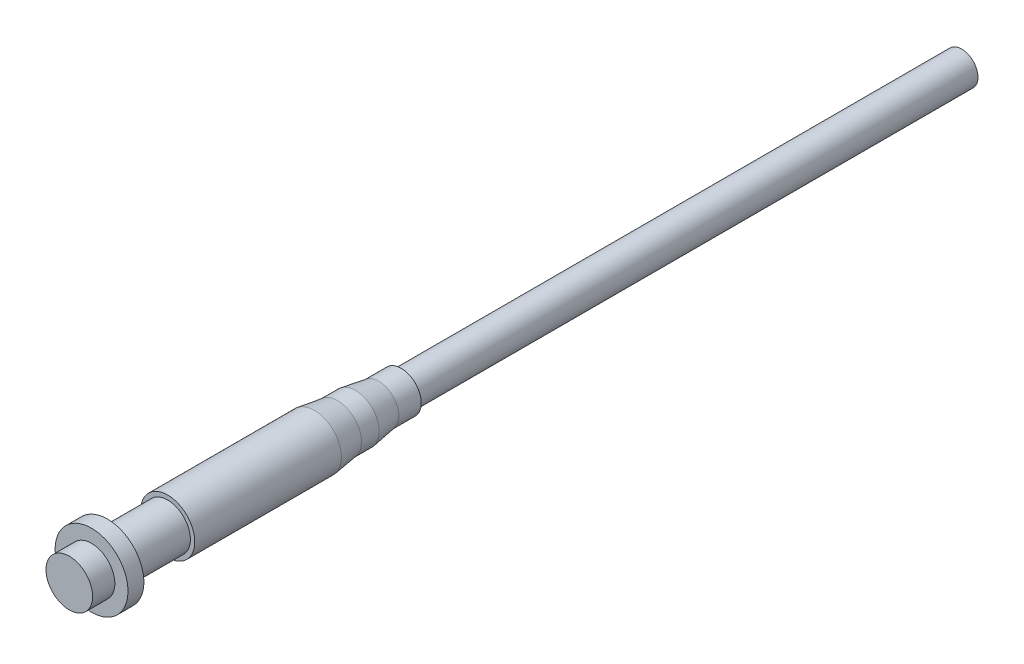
ISO-10303-21;
HEADER;
FILE_DESCRIPTION(('STEP AP214'),'2;1');
FILE_NAME('part.step','',(''),(''),'','','');
FILE_SCHEMA(('AUTOMOTIVE_DESIGN { 1 0 10303 214 1 1 1 1 }'));
ENDSEC;
DATA;
#1=APPLICATION_CONTEXT('core data for automotive mechanical design processes');
#2=APPLICATION_PROTOCOL_DEFINITION('international standard','automotive_design',2000,#1);
#3=PRODUCT_CONTEXT('',#1,'mechanical');
#4=PRODUCT('Part','Part','',(#3));
#5=PRODUCT_RELATED_PRODUCT_CATEGORY('part','',(#4));
#6=PRODUCT_DEFINITION_FORMATION('','',#4);
#7=PRODUCT_DEFINITION_CONTEXT('part definition',#1,'design');
#8=PRODUCT_DEFINITION('design','',#6,#7);
#9=PRODUCT_DEFINITION_SHAPE('','',#8);
#10=(LENGTH_UNIT() NAMED_UNIT(*) SI_UNIT(.MILLI.,.METRE.));
#11=(NAMED_UNIT(*) PLANE_ANGLE_UNIT() SI_UNIT($,.RADIAN.));
#12=(NAMED_UNIT(*) SI_UNIT($,.STERADIAN.) SOLID_ANGLE_UNIT());
#13=UNCERTAINTY_MEASURE_WITH_UNIT(LENGTH_MEASURE(1.E-05),#10,'distance_accuracy_value','');
#14=(GEOMETRIC_REPRESENTATION_CONTEXT(3) GLOBAL_UNCERTAINTY_ASSIGNED_CONTEXT((#13)) GLOBAL_UNIT_ASSIGNED_CONTEXT((#10,
#11,#12)) REPRESENTATION_CONTEXT('',''));
#15=CARTESIAN_POINT('',(0.,0.,0.));
#16=DIRECTION('',(0.,0.,1.));
#17=DIRECTION('',(1.,0.,0.));
#18=AXIS2_PLACEMENT_3D('',#15,#16,#17);
#19=CARTESIAN_POINT('',(-10.922,0.,-168.402));
#20=DIRECTION('',(0.,0.,-1.));
#21=DIRECTION('',(-1.,0.,0.));
#22=AXIS2_PLACEMENT_3D('',#19,#20,#21);
#23=PLANE('',#22);
#24=CARTESIAN_POINT('',(0.,0.,-168.402));
#25=DIRECTION('',(0.,0.,-1.));
#26=DIRECTION('',(-1.,0.,0.));
#27=AXIS2_PLACEMENT_3D('',#24,#25,#26);
#28=CIRCLE('',#27,10.922);
#29=CARTESIAN_POINT('',(-10.922,0.,-168.402));
#30=VERTEX_POINT('',#29);
#31=EDGE_CURVE('E65',#30,#30,#28,.T.);
#32=ORIENTED_EDGE('',*,*,#31,.T.);
#33=EDGE_LOOP('',(#32));
#34=FACE_BOUND('',#33,.T.);
#35=CARTESIAN_POINT('',(0.,0.,-168.402));
#36=DIRECTION('',(0.,0.,-1.));
#37=DIRECTION('',(-1.,0.,0.));
#38=AXIS2_PLACEMENT_3D('',#35,#36,#37);
#39=CIRCLE('',#38,8.89);
#40=CARTESIAN_POINT('',(8.88999999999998,0.,-168.402));
#41=VERTEX_POINT('',#40);
#42=EDGE_CURVE('E71',#41,#41,#39,.T.);
#43=ORIENTED_EDGE('',*,*,#42,.F.);
#44=EDGE_LOOP('',(#43));
#45=FACE_BOUND('',#44,.T.);
#46=ADVANCED_FACE('F24',(#34,#45),#23,.T.);
#47=CARTESIAN_POINT('',(0.,0.,12.0904));
#48=DIRECTION('',(0.,0.,1.));
#49=DIRECTION('',(1.,0.,0.));
#50=AXIS2_PLACEMENT_3D('',#47,#48,#49);
#51=PLANE('',#50);
#52=CARTESIAN_POINT('',(0.,0.,12.0904));
#53=DIRECTION('',(0.,0.,-1.));
#54=DIRECTION('',(-1.,0.,0.));
#55=AXIS2_PLACEMENT_3D('',#52,#53,#54);
#56=CIRCLE('',#55,12.6746);
#57=CARTESIAN_POINT('',(-12.6746,0.,12.0904));
#58=VERTEX_POINT('',#57);
#59=EDGE_CURVE('E10',#58,#58,#56,.T.);
#60=ORIENTED_EDGE('',*,*,#59,.F.);
#61=EDGE_LOOP('',(#60));
#62=FACE_BOUND('',#61,.T.);
#63=ADVANCED_FACE('F26',(#62),#51,.T.);
#64=CARTESIAN_POINT('',(0.,0.,-204.828193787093));
#65=DIRECTION('',(0.,0.,-1.));
#66=DIRECTION('',(-1.,0.,0.));
#67=AXIS2_PLACEMENT_3D('',#64,#65,#66);
#68=CYLINDRICAL_SURFACE('',#67,12.6746);
#69=ORIENTED_EDGE('',*,*,#59,.T.);
#70=EDGE_LOOP('',(#69));
#71=FACE_BOUND('',#70,.T.);
#72=CARTESIAN_POINT('',(0.,0.,0.));
#73=DIRECTION('',(0.,0.,-1.));
#74=DIRECTION('',(-1.,0.,0.));
#75=AXIS2_PLACEMENT_3D('',#72,#73,#74);
#76=CIRCLE('',#75,12.6746);
#77=CARTESIAN_POINT('',(-12.6746,0.,0.));
#78=VERTEX_POINT('',#77);
#79=EDGE_CURVE('E31',#78,#78,#76,.T.);
#80=ORIENTED_EDGE('',*,*,#79,.F.);
#81=EDGE_LOOP('',(#80));
#82=FACE_BOUND('',#81,.T.);
#83=ADVANCED_FACE('F85',(#71,#82),#68,.T.);
#84=CARTESIAN_POINT('',(-12.6746,0.,0.));
#85=DIRECTION('',(0.,0.,1.));
#86=DIRECTION('',(1.,0.,0.));
#87=AXIS2_PLACEMENT_3D('',#84,#85,#86);
#88=PLANE('',#87);
#89=ORIENTED_EDGE('',*,*,#79,.T.);
#90=EDGE_LOOP('',(#89));
#91=FACE_BOUND('',#90,.T.);
#92=CARTESIAN_POINT('',(0.,0.,0.));
#93=DIRECTION('',(0.,0.,-1.));
#94=DIRECTION('',(-1.,0.,0.));
#95=AXIS2_PLACEMENT_3D('',#92,#93,#94);
#96=CIRCLE('',#95,19.812);
#97=CARTESIAN_POINT('',(-19.812,0.,0.));
#98=VERTEX_POINT('',#97);
#99=EDGE_CURVE('E35',#98,#98,#96,.T.);
#100=ORIENTED_EDGE('',*,*,#99,.F.);
#101=EDGE_LOOP('',(#100));
#102=FACE_BOUND('',#101,.T.);
#103=ADVANCED_FACE('F124',(#91,#102),#88,.T.);
#104=CARTESIAN_POINT('',(0.,0.,-204.828193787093));
#105=DIRECTION('',(0.,0.,-1.));
#106=DIRECTION('',(-1.,0.,0.));
#107=AXIS2_PLACEMENT_3D('',#104,#105,#106);
#108=CYLINDRICAL_SURFACE('',#107,19.812);
#109=ORIENTED_EDGE('',*,*,#99,.T.);
#110=EDGE_LOOP('',(#109));
#111=FACE_BOUND('',#110,.T.);
#112=CARTESIAN_POINT('',(0.,0.,-8.636));
#113=DIRECTION('',(0.,0.,-1.));
#114=DIRECTION('',(-1.,0.,0.));
#115=AXIS2_PLACEMENT_3D('',#112,#113,#114);
#116=CIRCLE('',#115,19.812);
#117=CARTESIAN_POINT('',(-19.812,0.,-8.636));
#118=VERTEX_POINT('',#117);
#119=EDGE_CURVE('E39',#118,#118,#116,.T.);
#120=ORIENTED_EDGE('',*,*,#119,.F.);
#121=EDGE_LOOP('',(#120));
#122=FACE_BOUND('',#121,.T.);
#123=ADVANCED_FACE('F120',(#111,#122),#108,.T.);
#124=CARTESIAN_POINT('',(-19.812,0.,-8.636));
#125=DIRECTION('',(0.,0.,-1.));
#126=DIRECTION('',(-1.,0.,0.));
#127=AXIS2_PLACEMENT_3D('',#124,#125,#126);
#128=PLANE('',#127);
#129=ORIENTED_EDGE('',*,*,#119,.T.);
#130=EDGE_LOOP('',(#129));
#131=FACE_BOUND('',#130,.T.);
#132=CARTESIAN_POINT('',(0.,0.,-8.636));
#133=DIRECTION('',(0.,0.,-1.));
#134=DIRECTION('',(-1.,0.,0.));
#135=AXIS2_PLACEMENT_3D('',#132,#133,#134);
#136=CIRCLE('',#135,12.3825);
#137=CARTESIAN_POINT('',(-12.3825,0.,-8.636));
#138=VERTEX_POINT('',#137);
#139=EDGE_CURVE('E44',#138,#138,#136,.T.);
#140=ORIENTED_EDGE('',*,*,#139,.F.);
#141=EDGE_LOOP('',(#140));
#142=FACE_BOUND('',#141,.T.);
#143=ADVANCED_FACE('F116',(#131,#142),#128,.T.);
#144=CARTESIAN_POINT('',(0.,0.,-204.828193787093));
#145=DIRECTION('',(0.,0.,-1.));
#146=DIRECTION('',(-1.,0.,0.));
#147=AXIS2_PLACEMENT_3D('',#144,#145,#146);
#148=CYLINDRICAL_SURFACE('',#147,12.3825);
#149=ORIENTED_EDGE('',*,*,#139,.T.);
#150=EDGE_LOOP('',(#149));
#151=FACE_BOUND('',#150,.T.);
#152=CARTESIAN_POINT('',(0.,0.,-41.402));
#153=DIRECTION('',(0.,0.,-1.));
#154=DIRECTION('',(-1.,0.,0.));
#155=AXIS2_PLACEMENT_3D('',#152,#153,#154);
#156=CIRCLE('',#155,12.3825);
#157=CARTESIAN_POINT('',(-12.3825,0.,-41.402));
#158=VERTEX_POINT('',#157);
#159=EDGE_CURVE('E47',#158,#158,#156,.T.);
#160=ORIENTED_EDGE('',*,*,#159,.F.);
#161=EDGE_LOOP('',(#160));
#162=FACE_BOUND('',#161,.T.);
#163=ADVANCED_FACE('F112',(#151,#162),#148,.T.);
#164=CARTESIAN_POINT('',(-14.732,0.,-41.402));
#165=DIRECTION('',(0.,0.,1.));
#166=DIRECTION('',(1.,0.,0.));
#167=AXIS2_PLACEMENT_3D('',#164,#165,#166);
#168=PLANE('',#167);
#169=ORIENTED_EDGE('',*,*,#159,.T.);
#170=EDGE_LOOP('',(#169));
#171=FACE_BOUND('',#170,.T.);
#172=CARTESIAN_POINT('',(0.,0.,-41.402));
#173=DIRECTION('',(0.,0.,-1.));
#174=DIRECTION('',(-1.,0.,0.));
#175=AXIS2_PLACEMENT_3D('',#172,#173,#174);
#176=CIRCLE('',#175,14.732);
#177=CARTESIAN_POINT('',(-14.732,0.,-41.402));
#178=VERTEX_POINT('',#177);
#179=EDGE_CURVE('E50',#178,#178,#176,.T.);
#180=ORIENTED_EDGE('',*,*,#179,.F.);
#181=EDGE_LOOP('',(#180));
#182=FACE_BOUND('',#181,.T.);
#183=ADVANCED_FACE('F108',(#171,#182),#168,.T.);
#184=CARTESIAN_POINT('',(0.,0.,-204.828193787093));
#185=DIRECTION('',(0.,0.,-1.));
#186=DIRECTION('',(-1.,0.,0.));
#187=AXIS2_PLACEMENT_3D('',#184,#185,#186);
#188=CYLINDRICAL_SURFACE('',#187,14.732);
#189=ORIENTED_EDGE('',*,*,#179,.T.);
#190=EDGE_LOOP('',(#189));
#191=FACE_BOUND('',#190,.T.);
#192=CARTESIAN_POINT('',(0.,0.,-121.158));
#193=DIRECTION('',(0.,0.,-1.));
#194=DIRECTION('',(-1.,0.,0.));
#195=AXIS2_PLACEMENT_3D('',#192,#193,#194);
#196=CIRCLE('',#195,14.732);
#197=CARTESIAN_POINT('',(-14.732,0.,-121.158));
#198=VERTEX_POINT('',#197);
#199=EDGE_CURVE('E53',#198,#198,#196,.T.);
#200=ORIENTED_EDGE('',*,*,#199,.F.);
#201=EDGE_LOOP('',(#200));
#202=FACE_BOUND('',#201,.T.);
#203=ADVANCED_FACE('F104',(#191,#202),#188,.T.);
#204=CARTESIAN_POINT('',(0.,0.,-133.858));
#205=DIRECTION('',(0.,0.,1.));
#206=DIRECTION('',(1.,0.,0.));
#207=AXIS2_PLACEMENT_3D('',#204,#205,#206);
#208=CONICAL_SURFACE('',#207,12.954,0.139095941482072);
#209=ORIENTED_EDGE('',*,*,#199,.T.);
#210=EDGE_LOOP('',(#209));
#211=FACE_BOUND('',#210,.T.);
#212=CARTESIAN_POINT('',(0.,0.,-133.858));
#213=DIRECTION('',(0.,0.,-1.));
#214=DIRECTION('',(-1.,0.,0.));
#215=AXIS2_PLACEMENT_3D('',#212,#213,#214);
#216=CIRCLE('',#215,12.954);
#217=CARTESIAN_POINT('',(-12.954,0.,-133.858));
#218=VERTEX_POINT('',#217);
#219=EDGE_CURVE('E56',#218,#218,#216,.T.);
#220=ORIENTED_EDGE('',*,*,#219,.F.);
#221=EDGE_LOOP('',(#220));
#222=FACE_BOUND('',#221,.T.);
#223=ADVANCED_FACE('F100',(#211,#222),#208,.T.);
#224=CARTESIAN_POINT('',(0.,0.,-204.828193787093));
#225=DIRECTION('',(0.,0.,-1.));
#226=DIRECTION('',(-1.,0.,0.));
#227=AXIS2_PLACEMENT_3D('',#224,#225,#226);
#228=CYLINDRICAL_SURFACE('',#227,12.954);
#229=ORIENTED_EDGE('',*,*,#219,.T.);
#230=EDGE_LOOP('',(#229));
#231=FACE_BOUND('',#230,.T.);
#232=CARTESIAN_POINT('',(0.,0.,-143.51));
#233=DIRECTION('',(0.,0.,-1.));
#234=DIRECTION('',(-1.,0.,0.));
#235=AXIS2_PLACEMENT_3D('',#232,#233,#234);
#236=CIRCLE('',#235,12.954);
#237=CARTESIAN_POINT('',(-12.954,0.,-143.51));
#238=VERTEX_POINT('',#237);
#239=EDGE_CURVE('E59',#238,#238,#236,.T.);
#240=ORIENTED_EDGE('',*,*,#239,.F.);
#241=EDGE_LOOP('',(#240));
#242=FACE_BOUND('',#241,.T.);
#243=ADVANCED_FACE('F96',(#231,#242),#228,.T.);
#244=CARTESIAN_POINT('',(0.,0.,-156.21));
#245=DIRECTION('',(0.,0.,1.));
#246=DIRECTION('',(1.,0.,0.));
#247=AXIS2_PLACEMENT_3D('',#244,#245,#246);
#248=CONICAL_SURFACE('',#247,10.922,0.158655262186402);
#249=ORIENTED_EDGE('',*,*,#239,.T.);
#250=EDGE_LOOP('',(#249));
#251=FACE_BOUND('',#250,.T.);
#252=CARTESIAN_POINT('',(0.,0.,-156.21));
#253=DIRECTION('',(0.,0.,-1.));
#254=DIRECTION('',(-1.,0.,0.));
#255=AXIS2_PLACEMENT_3D('',#252,#253,#254);
#256=CIRCLE('',#255,10.922);
#257=CARTESIAN_POINT('',(-10.922,0.,-156.21));
#258=VERTEX_POINT('',#257);
#259=EDGE_CURVE('E62',#258,#258,#256,.T.);
#260=ORIENTED_EDGE('',*,*,#259,.F.);
#261=EDGE_LOOP('',(#260));
#262=FACE_BOUND('',#261,.T.);
#263=ADVANCED_FACE('F92',(#251,#262),#248,.T.);
#264=CARTESIAN_POINT('',(0.,0.,-204.828193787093));
#265=DIRECTION('',(0.,0.,-1.));
#266=DIRECTION('',(-1.,0.,0.));
#267=AXIS2_PLACEMENT_3D('',#264,#265,#266);
#268=CYLINDRICAL_SURFACE('',#267,10.922);
#269=ORIENTED_EDGE('',*,*,#259,.T.);
#270=EDGE_LOOP('',(#269));
#271=FACE_BOUND('',#270,.T.);
#272=ORIENTED_EDGE('',*,*,#31,.F.);
#273=EDGE_LOOP('',(#272));
#274=FACE_BOUND('',#273,.T.);
#275=ADVANCED_FACE('F90',(#271,#274),#268,.T.);
#276=CARTESIAN_POINT('',(0.,0.,-473.202));
#277=DIRECTION('',(0.,0.,1.));
#278=DIRECTION('',(1.,0.,0.));
#279=AXIS2_PLACEMENT_3D('',#276,#277,#278);
#280=CYLINDRICAL_SURFACE('',#279,8.89);
#281=CARTESIAN_POINT('',(0.,0.,-473.202));
#282=DIRECTION('',(0.,0.,-1.));
#283=DIRECTION('',(-1.,0.,0.));
#284=AXIS2_PLACEMENT_3D('',#281,#282,#283);
#285=CIRCLE('',#284,8.89);
#286=CARTESIAN_POINT('',(8.88999999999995,0.,-473.202));
#287=VERTEX_POINT('',#286);
#288=EDGE_CURVE('E68',#287,#287,#285,.T.);
#289=CARTESIAN_POINT('',(8.88999999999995,0.,-473.202));
#290=CARTESIAN_POINT('',(8.88999999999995,0.,-470.027));
#291=CARTESIAN_POINT('',(8.88999999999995,0.,-466.852));
#292=CARTESIAN_POINT('',(8.88999999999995,0.,-460.502));
#293=CARTESIAN_POINT('',(8.88999999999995,0.,-457.327));
#294=CARTESIAN_POINT('',(8.88999999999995,0.,-450.977));
#295=CARTESIAN_POINT('',(8.88999999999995,0.,-447.802));
#296=CARTESIAN_POINT('',(8.88999999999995,0.,-441.452));
#297=CARTESIAN_POINT('',(8.88999999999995,0.,-438.277));
#298=CARTESIAN_POINT('',(8.88999999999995,0.,-431.927));
#299=CARTESIAN_POINT('',(8.88999999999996,0.,-428.752));
#300=CARTESIAN_POINT('',(8.88999999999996,0.,-422.402));
#301=CARTESIAN_POINT('',(8.88999999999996,0.,-419.227));
#302=CARTESIAN_POINT('',(8.88999999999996,0.,-412.877));
#303=CARTESIAN_POINT('',(8.88999999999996,0.,-409.702));
#304=CARTESIAN_POINT('',(8.88999999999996,0.,-403.352));
#305=CARTESIAN_POINT('',(8.88999999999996,0.,-400.177));
#306=CARTESIAN_POINT('',(8.88999999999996,0.,-393.827));
#307=CARTESIAN_POINT('',(8.88999999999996,0.,-390.652));
#308=CARTESIAN_POINT('',(8.88999999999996,0.,-384.302));
#309=CARTESIAN_POINT('',(8.88999999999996,0.,-381.127));
#310=CARTESIAN_POINT('',(8.88999999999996,0.,-374.777));
#311=CARTESIAN_POINT('',(8.88999999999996,0.,-371.602));
#312=CARTESIAN_POINT('',(8.88999999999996,0.,-365.252));
#313=CARTESIAN_POINT('',(8.88999999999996,0.,-362.077));
#314=CARTESIAN_POINT('',(8.88999999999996,0.,-355.727));
#315=CARTESIAN_POINT('',(8.88999999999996,0.,-352.552));
#316=CARTESIAN_POINT('',(8.88999999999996,0.,-346.202));
#317=CARTESIAN_POINT('',(8.88999999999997,0.,-343.027));
#318=CARTESIAN_POINT('',(8.88999999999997,0.,-336.677));
#319=CARTESIAN_POINT('',(8.88999999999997,0.,-333.502));
#320=CARTESIAN_POINT('',(8.88999999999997,0.,-327.152));
#321=CARTESIAN_POINT('',(8.88999999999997,0.,-323.977));
#322=CARTESIAN_POINT('',(8.88999999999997,0.,-317.627));
#323=CARTESIAN_POINT('',(8.88999999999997,0.,-314.452));
#324=CARTESIAN_POINT('',(8.88999999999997,0.,-308.102));
#325=CARTESIAN_POINT('',(8.88999999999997,0.,-304.927));
#326=CARTESIAN_POINT('',(8.88999999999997,0.,-298.577));
#327=CARTESIAN_POINT('',(8.88999999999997,0.,-295.402));
#328=CARTESIAN_POINT('',(8.88999999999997,0.,-289.052));
#329=CARTESIAN_POINT('',(8.88999999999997,0.,-285.877));
#330=CARTESIAN_POINT('',(8.88999999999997,0.,-279.527));
#331=CARTESIAN_POINT('',(8.88999999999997,0.,-276.352));
#332=CARTESIAN_POINT('',(8.88999999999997,0.,-270.002));
#333=CARTESIAN_POINT('',(8.88999999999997,0.,-266.827));
#334=CARTESIAN_POINT('',(8.88999999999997,0.,-260.477));
#335=CARTESIAN_POINT('',(8.88999999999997,0.,-257.302));
#336=CARTESIAN_POINT('',(8.88999999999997,0.,-250.952));
#337=CARTESIAN_POINT('',(8.88999999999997,0.,-247.777));
#338=CARTESIAN_POINT('',(8.88999999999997,0.,-241.427));
#339=CARTESIAN_POINT('',(8.88999999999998,0.,-238.252));
#340=CARTESIAN_POINT('',(8.88999999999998,0.,-231.902));
#341=CARTESIAN_POINT('',(8.88999999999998,0.,-228.727));
#342=CARTESIAN_POINT('',(8.88999999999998,0.,-222.377));
#343=CARTESIAN_POINT('',(8.88999999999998,0.,-219.202));
#344=CARTESIAN_POINT('',(8.88999999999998,0.,-212.852));
#345=CARTESIAN_POINT('',(8.88999999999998,0.,-209.677));
#346=CARTESIAN_POINT('',(8.88999999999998,0.,-203.327));
#347=CARTESIAN_POINT('',(8.88999999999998,0.,-200.152));
#348=CARTESIAN_POINT('',(8.88999999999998,0.,-193.802));
#349=CARTESIAN_POINT('',(8.88999999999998,0.,-190.627));
#350=CARTESIAN_POINT('',(8.88999999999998,0.,-184.277));
#351=CARTESIAN_POINT('',(8.88999999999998,0.,-181.102));
#352=CARTESIAN_POINT('',(8.88999999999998,0.,-174.752));
#353=CARTESIAN_POINT('',(8.88999999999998,0.,-171.577));
#354=CARTESIAN_POINT('',(8.88999999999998,0.,-168.402));
#355=B_SPLINE_CURVE_WITH_KNOTS('',3,(#289,#290,#291,#292,#293,#294,#295,#296,#297,#298,#299,
#300,#301,#302,#303,#304,#305,#306,#307,#308,#309,#310,#311,#312,#313,#314,#315,#316,#317,#318,
#319,#320,#321,#322,#323,#324,#325,#326,#327,#328,#329,#330,#331,#332,#333,#334,#335,#336,#337,
#338,#339,#340,#341,#342,#343,#344,#345,#346,#347,#348,#349,#350,#351,#352,#353,#354),
.UNSPECIFIED.,.F.,.F.,(4,2,2,2,2,2,2,2,2,2,2,2,2,2,2,2,2,2,2,2,2,2,2,2,2,2,2,2,2,2,2,2,4),(0.,
9.52499999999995,19.05,28.575,38.1,47.625,57.15,66.675,76.2,85.725,95.25,104.775,114.3,123.825,
133.35,142.875,152.4,161.925,171.45,180.975,190.5,200.025,209.55,219.075,228.6,238.125,247.65,
257.175,266.7,276.225,285.75,295.275,304.8),.UNSPECIFIED.);
#356=EDGE_CURVE('BSEAM75',#287,#41,#355,.T.);
#357=ORIENTED_EDGE('',*,*,#288,.F.);
#358=ORIENTED_EDGE('',*,*,#42,.T.);
#359=ORIENTED_EDGE('',*,*,#356,.T.);
#360=ORIENTED_EDGE('',*,*,#356,.F.);
#361=EDGE_LOOP('',(#357,#359,#358,#360));
#362=FACE_BOUND('',#361,.T.);
#363=ADVANCED_FACE('F75',(#362),#280,.T.);
#364=CARTESIAN_POINT('',(0.,0.,-473.202));
#365=DIRECTION('',(0.,0.,-1.));
#366=DIRECTION('',(-1.,0.,0.));
#367=AXIS2_PLACEMENT_3D('',#364,#365,#366);
#368=PLANE('',#367);
#369=ORIENTED_EDGE('',*,*,#288,.T.);
#370=EDGE_LOOP('',(#369));
#371=FACE_BOUND('',#370,.T.);
#372=ADVANCED_FACE('F181',(#371),#368,.T.);
#373=CLOSED_SHELL('',(#46,#63,#83,#103,#123,#143,#163,#183,#203,#223,#243,#263,#275,#363,#372));
#374=MANIFOLD_SOLID_BREP('B2',#373);
#375=ADVANCED_BREP_SHAPE_REPRESENTATION('',(#18,#374),#14);
#376=SHAPE_DEFINITION_REPRESENTATION(#9,#375);
ENDSEC;
END-ISO-10303-21;
